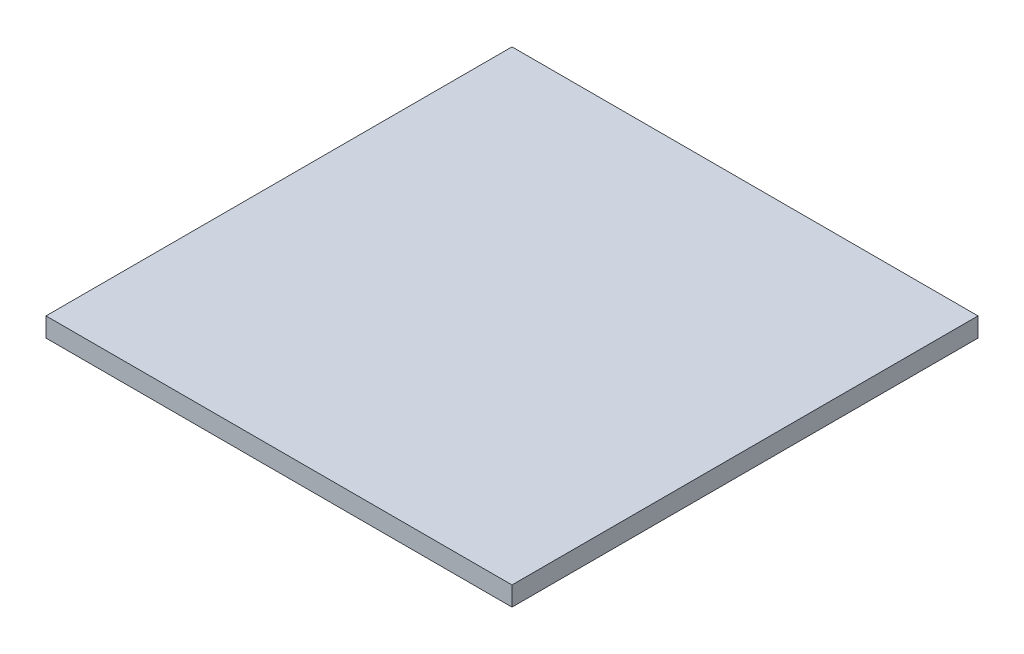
ISO-10303-21;
HEADER;
FILE_DESCRIPTION(('STEP AP214'),'2;1');
FILE_NAME('part.step','',(''),(''),'','','');
FILE_SCHEMA(('AUTOMOTIVE_DESIGN { 1 0 10303 214 1 1 1 1 }'));
ENDSEC;
DATA;
#1=APPLICATION_CONTEXT('core data for automotive mechanical design processes');
#2=APPLICATION_PROTOCOL_DEFINITION('international standard','automotive_design',2000,#1);
#3=PRODUCT_CONTEXT('',#1,'mechanical');
#4=PRODUCT('Part','Part','',(#3));
#5=PRODUCT_RELATED_PRODUCT_CATEGORY('part','',(#4));
#6=PRODUCT_DEFINITION_FORMATION('','',#4);
#7=PRODUCT_DEFINITION_CONTEXT('part definition',#1,'design');
#8=PRODUCT_DEFINITION('design','',#6,#7);
#9=PRODUCT_DEFINITION_SHAPE('','',#8);
#10=(LENGTH_UNIT() NAMED_UNIT(*) SI_UNIT(.MILLI.,.METRE.));
#11=(NAMED_UNIT(*) PLANE_ANGLE_UNIT() SI_UNIT($,.RADIAN.));
#12=(NAMED_UNIT(*) SI_UNIT($,.STERADIAN.) SOLID_ANGLE_UNIT());
#13=UNCERTAINTY_MEASURE_WITH_UNIT(LENGTH_MEASURE(1.E-05),#10,'distance_accuracy_value','');
#14=(GEOMETRIC_REPRESENTATION_CONTEXT(3) GLOBAL_UNCERTAINTY_ASSIGNED_CONTEXT((#13)) GLOBAL_UNIT_ASSIGNED_CONTEXT((#10,
#11,#12)) REPRESENTATION_CONTEXT('',''));
#15=CARTESIAN_POINT('',(0.,0.,0.));
#16=DIRECTION('',(0.,0.,1.));
#17=DIRECTION('',(1.,0.,0.));
#18=AXIS2_PLACEMENT_3D('',#15,#16,#17);
#19=CARTESIAN_POINT('',(15.125,1.25,15.125));
#20=DIRECTION('',(-1.,0.,0.));
#21=DIRECTION('',(0.,0.,1.));
#22=AXIS2_PLACEMENT_3D('',#19,#20,#21);
#23=PLANE('',#22);
#24=DIRECTION('',(0.,0.,-1.));
#25=VECTOR('',#24,1.);
#26=CARTESIAN_POINT('',(15.125,0.,15.125));
#27=LINE('',#26,#25);
#28=CARTESIAN_POINT('',(15.125,0.,15.125));
#29=VERTEX_POINT('',#28);
#30=CARTESIAN_POINT('',(15.125,0.,-15.125));
#31=VERTEX_POINT('',#30);
#32=EDGE_CURVE('E109',#29,#31,#27,.T.);
#33=ORIENTED_EDGE('',*,*,#32,.T.);
#34=DIRECTION('',(0.,-1.,0.));
#35=VECTOR('',#34,1.);
#36=CARTESIAN_POINT('',(15.125,1.25,-15.125));
#37=LINE('',#36,#35);
#38=CARTESIAN_POINT('',(15.125,1.25,-15.125));
#39=VERTEX_POINT('',#38);
#40=EDGE_CURVE('E11',#39,#31,#37,.T.);
#41=ORIENTED_EDGE('',*,*,#40,.F.);
#42=DIRECTION('',(0.,0.,-1.));
#43=VECTOR('',#42,1.);
#44=CARTESIAN_POINT('',(15.125,1.25,15.125));
#45=LINE('',#44,#43);
#46=CARTESIAN_POINT('',(15.125,1.25,15.125));
#47=VERTEX_POINT('',#46);
#48=EDGE_CURVE('E93',#47,#39,#45,.T.);
#49=ORIENTED_EDGE('',*,*,#48,.F.);
#50=DIRECTION('',(0.,-1.,0.));
#51=VECTOR('',#50,1.);
#52=CARTESIAN_POINT('',(15.125,1.25,15.125));
#53=LINE('',#52,#51);
#54=EDGE_CURVE('E105',#47,#29,#53,.T.);
#55=ORIENTED_EDGE('',*,*,#54,.T.);
#56=EDGE_LOOP('',(#33,#41,#49,#55));
#57=FACE_BOUND('',#56,.T.);
#58=ADVANCED_FACE('F41',(#57),#23,.F.);
#59=CARTESIAN_POINT('',(-15.125,1.25,-15.125));
#60=DIRECTION('',(0.,0.,1.));
#61=DIRECTION('',(1.,0.,0.));
#62=AXIS2_PLACEMENT_3D('',#59,#60,#61);
#63=PLANE('',#62);
#64=DIRECTION('',(-1.,0.,0.));
#65=VECTOR('',#64,1.);
#66=CARTESIAN_POINT('',(-15.125,0.,-15.125));
#67=LINE('',#66,#65);
#68=CARTESIAN_POINT('',(-15.125,0.,-15.125));
#69=VERTEX_POINT('',#68);
#70=EDGE_CURVE('E98',#31,#69,#67,.T.);
#71=ORIENTED_EDGE('',*,*,#70,.T.);
#72=DIRECTION('',(0.,-1.,0.));
#73=VECTOR('',#72,1.);
#74=CARTESIAN_POINT('',(-15.125,1.25,-15.125));
#75=LINE('',#74,#73);
#76=CARTESIAN_POINT('',(-15.125,1.25,-15.125));
#77=VERTEX_POINT('',#76);
#78=EDGE_CURVE('E50',#77,#69,#75,.T.);
#79=ORIENTED_EDGE('',*,*,#78,.F.);
#80=DIRECTION('',(-1.,0.,0.));
#81=VECTOR('',#80,1.);
#82=CARTESIAN_POINT('',(-15.125,1.25,-15.125));
#83=LINE('',#82,#81);
#84=EDGE_CURVE('E88',#39,#77,#83,.T.);
#85=ORIENTED_EDGE('',*,*,#84,.F.);
#86=ORIENTED_EDGE('',*,*,#40,.T.);
#87=EDGE_LOOP('',(#71,#79,#85,#86));
#88=FACE_BOUND('',#87,.T.);
#89=ADVANCED_FACE('F97',(#88),#63,.F.);
#90=CARTESIAN_POINT('',(-15.125,1.25,15.125));
#91=DIRECTION('',(1.,0.,0.));
#92=DIRECTION('',(0.,0.,-1.));
#93=AXIS2_PLACEMENT_3D('',#90,#91,#92);
#94=PLANE('',#93);
#95=DIRECTION('',(0.,0.,1.));
#96=VECTOR('',#95,1.);
#97=CARTESIAN_POINT('',(-15.125,0.,15.125));
#98=LINE('',#97,#96);
#99=CARTESIAN_POINT('',(-15.125,0.,15.125));
#100=VERTEX_POINT('',#99);
#101=EDGE_CURVE('E75',#69,#100,#98,.T.);
#102=ORIENTED_EDGE('',*,*,#101,.T.);
#103=DIRECTION('',(0.,-1.,0.));
#104=VECTOR('',#103,1.);
#105=CARTESIAN_POINT('',(-15.125,1.25,15.125));
#106=LINE('',#105,#104);
#107=CARTESIAN_POINT('',(-15.125,1.25,15.125));
#108=VERTEX_POINT('',#107);
#109=EDGE_CURVE('E100',#108,#100,#106,.T.);
#110=ORIENTED_EDGE('',*,*,#109,.F.);
#111=DIRECTION('',(0.,0.,1.));
#112=VECTOR('',#111,1.);
#113=CARTESIAN_POINT('',(-15.125,1.25,15.125));
#114=LINE('',#113,#112);
#115=EDGE_CURVE('E91',#77,#108,#114,.T.);
#116=ORIENTED_EDGE('',*,*,#115,.F.);
#117=ORIENTED_EDGE('',*,*,#78,.T.);
#118=EDGE_LOOP('',(#102,#110,#116,#117));
#119=FACE_BOUND('',#118,.T.);
#120=ADVANCED_FACE('F101',(#119),#94,.F.);
#121=CARTESIAN_POINT('',(-15.125,1.25,15.125));
#122=DIRECTION('',(0.,0.,-1.));
#123=DIRECTION('',(-1.,0.,0.));
#124=AXIS2_PLACEMENT_3D('',#121,#122,#123);
#125=PLANE('',#124);
#126=DIRECTION('',(1.,0.,0.));
#127=VECTOR('',#126,1.);
#128=CARTESIAN_POINT('',(-15.125,0.,15.125));
#129=LINE('',#128,#127);
#130=EDGE_CURVE('E81',#100,#29,#129,.T.);
#131=ORIENTED_EDGE('',*,*,#130,.T.);
#132=ORIENTED_EDGE('',*,*,#54,.F.);
#133=DIRECTION('',(1.,0.,0.));
#134=VECTOR('',#133,1.);
#135=CARTESIAN_POINT('',(-15.125,1.25,15.125));
#136=LINE('',#135,#134);
#137=EDGE_CURVE('E58',#108,#47,#136,.T.);
#138=ORIENTED_EDGE('',*,*,#137,.F.);
#139=ORIENTED_EDGE('',*,*,#109,.T.);
#140=EDGE_LOOP('',(#131,#132,#138,#139));
#141=FACE_BOUND('',#140,.T.);
#142=ADVANCED_FACE('F122',(#141),#125,.F.);
#143=CARTESIAN_POINT('',(0.,1.25,0.));
#144=DIRECTION('',(0.,-1.,0.));
#145=DIRECTION('',(0.,0.,-1.));
#146=AXIS2_PLACEMENT_3D('',#143,#144,#145);
#147=PLANE('',#146);
#148=ORIENTED_EDGE('',*,*,#48,.T.);
#149=ORIENTED_EDGE('',*,*,#84,.T.);
#150=ORIENTED_EDGE('',*,*,#115,.T.);
#151=ORIENTED_EDGE('',*,*,#137,.T.);
#152=EDGE_LOOP('',(#148,#149,#150,#151));
#153=FACE_BOUND('',#152,.T.);
#154=ADVANCED_FACE('F89',(#153),#147,.F.);
#155=CARTESIAN_POINT('',(0.,0.,0.));
#156=DIRECTION('',(0.,-1.,0.));
#157=DIRECTION('',(0.,0.,-1.));
#158=AXIS2_PLACEMENT_3D('',#155,#156,#157);
#159=PLANE('',#158);
#160=ORIENTED_EDGE('',*,*,#32,.F.);
#161=ORIENTED_EDGE('',*,*,#130,.F.);
#162=ORIENTED_EDGE('',*,*,#101,.F.);
#163=ORIENTED_EDGE('',*,*,#70,.F.);
#164=EDGE_LOOP('',(#160,#161,#162,#163));
#165=FACE_BOUND('',#164,.T.);
#166=ADVANCED_FACE('F125',(#165),#159,.T.);
#167=CLOSED_SHELL('',(#58,#89,#120,#142,#154,#166));
#168=MANIFOLD_SOLID_BREP('B2',#167);
#169=ADVANCED_BREP_SHAPE_REPRESENTATION('',(#18,#168),#14);
#170=SHAPE_DEFINITION_REPRESENTATION(#9,#169);
ENDSEC;
END-ISO-10303-21;
